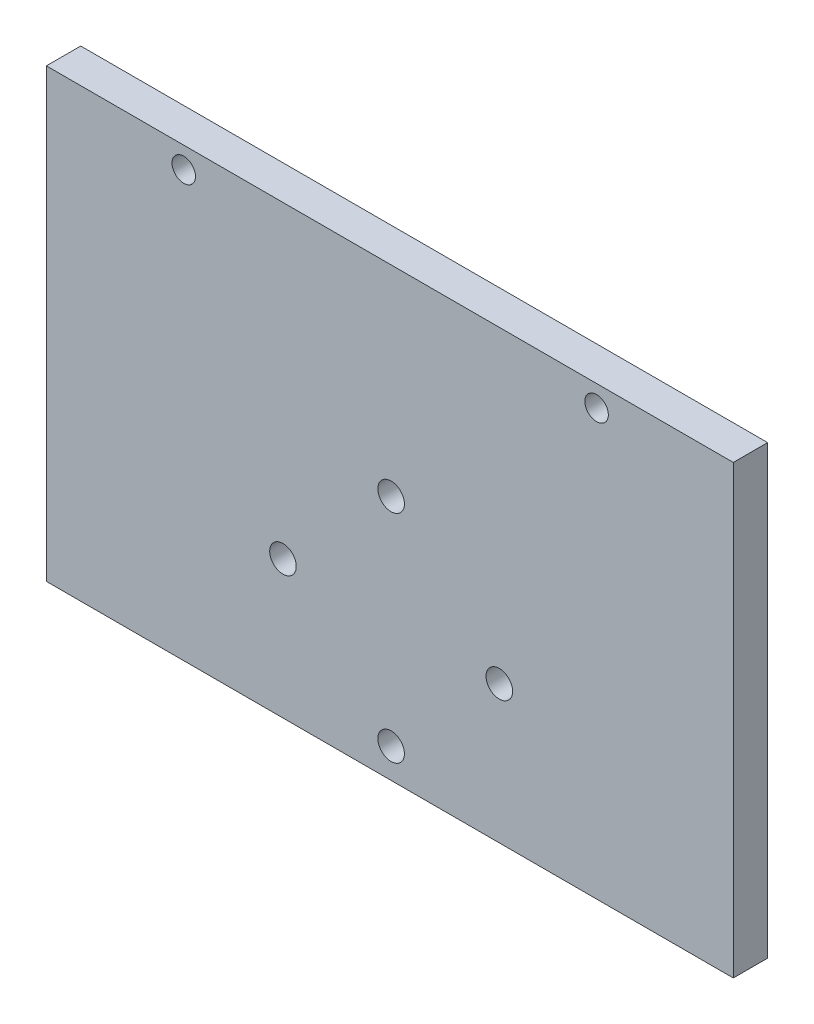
ISO-10303-21;
HEADER;
FILE_DESCRIPTION(('STEP AP214'),'2;1');
FILE_NAME('part.step','',(''),(''),'','','');
FILE_SCHEMA(('AUTOMOTIVE_DESIGN { 1 0 10303 214 1 1 1 1 }'));
ENDSEC;
DATA;
#1=APPLICATION_CONTEXT('core data for automotive mechanical design processes');
#2=APPLICATION_PROTOCOL_DEFINITION('international standard','automotive_design',2000,#1);
#3=PRODUCT_CONTEXT('',#1,'mechanical');
#4=PRODUCT('Part','Part','',(#3));
#5=PRODUCT_RELATED_PRODUCT_CATEGORY('part','',(#4));
#6=PRODUCT_DEFINITION_FORMATION('','',#4);
#7=PRODUCT_DEFINITION_CONTEXT('part definition',#1,'design');
#8=PRODUCT_DEFINITION('design','',#6,#7);
#9=PRODUCT_DEFINITION_SHAPE('','',#8);
#10=(LENGTH_UNIT() NAMED_UNIT(*) SI_UNIT(.MILLI.,.METRE.));
#11=(NAMED_UNIT(*) PLANE_ANGLE_UNIT() SI_UNIT($,.RADIAN.));
#12=(NAMED_UNIT(*) SI_UNIT($,.STERADIAN.) SOLID_ANGLE_UNIT());
#13=UNCERTAINTY_MEASURE_WITH_UNIT(LENGTH_MEASURE(1.E-05),#10,'distance_accuracy_value','');
#14=(GEOMETRIC_REPRESENTATION_CONTEXT(3) GLOBAL_UNCERTAINTY_ASSIGNED_CONTEXT((#13)) GLOBAL_UNIT_ASSIGNED_CONTEXT((#10,
#11,#12)) REPRESENTATION_CONTEXT('',''));
#15=CARTESIAN_POINT('',(0.,0.,0.));
#16=DIRECTION('',(0.,0.,1.));
#17=DIRECTION('',(1.,0.,0.));
#18=AXIS2_PLACEMENT_3D('',#15,#16,#17);
#19=CARTESIAN_POINT('',(63.5,-41.275,6.35));
#20=DIRECTION('',(-1.,0.,0.));
#21=DIRECTION('',(0.,0.,1.));
#22=AXIS2_PLACEMENT_3D('',#19,#20,#21);
#23=PLANE('',#22);
#24=DIRECTION('',(0.,1.,0.));
#25=VECTOR('',#24,1.);
#26=CARTESIAN_POINT('',(63.5,-41.275,0.));
#27=LINE('',#26,#25);
#28=CARTESIAN_POINT('',(63.5,-41.275,0.));
#29=VERTEX_POINT('',#28);
#30=CARTESIAN_POINT('',(63.5,41.275,0.));
#31=VERTEX_POINT('',#30);
#32=EDGE_CURVE('E98',#29,#31,#27,.T.);
#33=ORIENTED_EDGE('',*,*,#32,.T.);
#34=DIRECTION('',(0.,0.,-1.));
#35=VECTOR('',#34,1.);
#36=CARTESIAN_POINT('',(63.5,41.275,6.35));
#37=LINE('',#36,#35);
#38=CARTESIAN_POINT('',(63.5,41.275,6.35));
#39=VERTEX_POINT('',#38);
#40=EDGE_CURVE('E11',#39,#31,#37,.T.);
#41=ORIENTED_EDGE('',*,*,#40,.F.);
#42=DIRECTION('',(0.,1.,0.));
#43=VECTOR('',#42,1.);
#44=CARTESIAN_POINT('',(63.5,-41.275,6.35));
#45=LINE('',#44,#43);
#46=CARTESIAN_POINT('',(63.5,-41.275,6.35));
#47=VERTEX_POINT('',#46);
#48=EDGE_CURVE('E86',#47,#39,#45,.T.);
#49=ORIENTED_EDGE('',*,*,#48,.F.);
#50=DIRECTION('',(0.,0.,-1.));
#51=VECTOR('',#50,1.);
#52=CARTESIAN_POINT('',(63.5,-41.275,6.35));
#53=LINE('',#52,#51);
#54=EDGE_CURVE('E94',#47,#29,#53,.T.);
#55=ORIENTED_EDGE('',*,*,#54,.T.);
#56=EDGE_LOOP('',(#33,#41,#49,#55));
#57=FACE_BOUND('',#56,.T.);
#58=ADVANCED_FACE('F35',(#57),#23,.F.);
#59=CARTESIAN_POINT('',(-63.5,41.275,6.35));
#60=DIRECTION('',(0.,-1.,0.));
#61=DIRECTION('',(0.,0.,-1.));
#62=AXIS2_PLACEMENT_3D('',#59,#60,#61);
#63=PLANE('',#62);
#64=DIRECTION('',(-1.,0.,0.));
#65=VECTOR('',#64,1.);
#66=CARTESIAN_POINT('',(-63.5,41.275,0.));
#67=LINE('',#66,#65);
#68=CARTESIAN_POINT('',(-63.5,41.275,0.));
#69=VERTEX_POINT('',#68);
#70=EDGE_CURVE('E90',#31,#69,#67,.T.);
#71=ORIENTED_EDGE('',*,*,#70,.T.);
#72=DIRECTION('',(0.,0.,-1.));
#73=VECTOR('',#72,1.);
#74=CARTESIAN_POINT('',(-63.5,41.275,6.35));
#75=LINE('',#74,#73);
#76=CARTESIAN_POINT('',(-63.5,41.275,6.35));
#77=VERTEX_POINT('',#76);
#78=EDGE_CURVE('E43',#77,#69,#75,.T.);
#79=ORIENTED_EDGE('',*,*,#78,.F.);
#80=DIRECTION('',(-1.,0.,0.));
#81=VECTOR('',#80,1.);
#82=CARTESIAN_POINT('',(-63.5,41.275,6.35));
#83=LINE('',#82,#81);
#84=EDGE_CURVE('E81',#39,#77,#83,.T.);
#85=ORIENTED_EDGE('',*,*,#84,.F.);
#86=ORIENTED_EDGE('',*,*,#40,.T.);
#87=EDGE_LOOP('',(#71,#79,#85,#86));
#88=FACE_BOUND('',#87,.T.);
#89=ADVANCED_FACE('F89',(#88),#63,.F.);
#90=CARTESIAN_POINT('',(-63.5,-41.275,6.35));
#91=DIRECTION('',(1.,0.,0.));
#92=DIRECTION('',(0.,0.,-1.));
#93=AXIS2_PLACEMENT_3D('',#90,#91,#92);
#94=PLANE('',#93);
#95=DIRECTION('',(0.,-1.,0.));
#96=VECTOR('',#95,1.);
#97=CARTESIAN_POINT('',(-63.5,-41.275,0.));
#98=LINE('',#97,#96);
#99=CARTESIAN_POINT('',(-63.5,-41.275,0.));
#100=VERTEX_POINT('',#99);
#101=EDGE_CURVE('E68',#69,#100,#98,.T.);
#102=ORIENTED_EDGE('',*,*,#101,.T.);
#103=DIRECTION('',(0.,0.,-1.));
#104=VECTOR('',#103,1.);
#105=CARTESIAN_POINT('',(-63.5,-41.275,6.35));
#106=LINE('',#105,#104);
#107=CARTESIAN_POINT('',(-63.5,-41.275,6.35));
#108=VERTEX_POINT('',#107);
#109=EDGE_CURVE('E91',#108,#100,#106,.T.);
#110=ORIENTED_EDGE('',*,*,#109,.F.);
#111=DIRECTION('',(0.,-1.,0.));
#112=VECTOR('',#111,1.);
#113=CARTESIAN_POINT('',(-63.5,-41.275,6.35));
#114=LINE('',#113,#112);
#115=EDGE_CURVE('E84',#77,#108,#114,.T.);
#116=ORIENTED_EDGE('',*,*,#115,.F.);
#117=ORIENTED_EDGE('',*,*,#78,.T.);
#118=EDGE_LOOP('',(#102,#110,#116,#117));
#119=FACE_BOUND('',#118,.T.);
#120=ADVANCED_FACE('F92',(#119),#94,.F.);
#121=CARTESIAN_POINT('',(-63.5,-41.275,6.35));
#122=DIRECTION('',(0.,1.,0.));
#123=DIRECTION('',(0.,0.,1.));
#124=AXIS2_PLACEMENT_3D('',#121,#122,#123);
#125=PLANE('',#124);
#126=DIRECTION('',(1.,0.,0.));
#127=VECTOR('',#126,1.);
#128=CARTESIAN_POINT('',(-63.5,-41.275,0.));
#129=LINE('',#128,#127);
#130=EDGE_CURVE('E74',#100,#29,#129,.T.);
#131=ORIENTED_EDGE('',*,*,#130,.T.);
#132=ORIENTED_EDGE('',*,*,#54,.F.);
#133=DIRECTION('',(1.,0.,0.));
#134=VECTOR('',#133,1.);
#135=CARTESIAN_POINT('',(-63.5,-41.275,6.35));
#136=LINE('',#135,#134);
#137=EDGE_CURVE('E51',#108,#47,#136,.T.);
#138=ORIENTED_EDGE('',*,*,#137,.F.);
#139=ORIENTED_EDGE('',*,*,#109,.T.);
#140=EDGE_LOOP('',(#131,#132,#138,#139));
#141=FACE_BOUND('',#140,.T.);
#142=ADVANCED_FACE('F106',(#141),#125,.F.);
#143=CARTESIAN_POINT('',(0.,0.,6.35));
#144=DIRECTION('',(0.,0.,-1.));
#145=DIRECTION('',(-1.,0.,0.));
#146=AXIS2_PLACEMENT_3D('',#143,#144,#145);
#147=PLANE('',#146);
#148=CARTESIAN_POINT('',(38.2260586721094,37.338,6.35));
#149=DIRECTION('',(0.,0.,1.));
#150=DIRECTION('',(1.,0.,0.));
#151=AXIS2_PLACEMENT_3D('',#148,#149,#150);
#152=CIRCLE('',#151,2.1717);
#153=CARTESIAN_POINT('',(40.3977586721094,37.338,6.35));
#154=VERTEX_POINT('',#153);
#155=EDGE_CURVE('E142',#154,#154,#152,.T.);
#156=ORIENTED_EDGE('',*,*,#155,.F.);
#157=EDGE_LOOP('',(#156));
#158=FACE_BOUND('',#157,.T.);
#159=CARTESIAN_POINT('',(-38.1,37.338,6.35));
#160=DIRECTION('',(0.,0.,1.));
#161=DIRECTION('',(1.,0.,0.));
#162=AXIS2_PLACEMENT_3D('',#159,#160,#161);
#163=CIRCLE('',#162,2.1717);
#164=CARTESIAN_POINT('',(-35.9283,37.338,6.35));
#165=VERTEX_POINT('',#164);
#166=EDGE_CURVE('E136',#165,#165,#163,.T.);
#167=ORIENTED_EDGE('',*,*,#166,.F.);
#168=EDGE_LOOP('',(#167));
#169=FACE_BOUND('',#168,.T.);
#170=CARTESIAN_POINT('',(20.2431563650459,-15.7889200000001,6.35));
#171=DIRECTION('',(0.,0.,1.));
#172=DIRECTION('',(1.,0.,0.));
#173=AXIS2_PLACEMENT_3D('',#170,#171,#172);
#174=CIRCLE('',#173,2.45744999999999);
#175=CARTESIAN_POINT('',(22.7006063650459,-15.7889200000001,6.35));
#176=VERTEX_POINT('',#175);
#177=EDGE_CURVE('E132',#176,#176,#174,.T.);
#178=ORIENTED_EDGE('',*,*,#177,.F.);
#179=EDGE_LOOP('',(#178));
#180=FACE_BOUND('',#179,.T.);
#181=CARTESIAN_POINT('',(-19.7568436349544,-15.78892,6.35));
#182=DIRECTION('',(0.,0.,1.));
#183=DIRECTION('',(1.,0.,0.));
#184=AXIS2_PLACEMENT_3D('',#181,#182,#183);
#185=CIRCLE('',#184,2.45744999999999);
#186=CARTESIAN_POINT('',(-17.2993936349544,-15.78892,6.35));
#187=VERTEX_POINT('',#186);
#188=EDGE_CURVE('E126',#187,#187,#185,.T.);
#189=ORIENTED_EDGE('',*,*,#188,.F.);
#190=EDGE_LOOP('',(#189));
#191=FACE_BOUND('',#190,.T.);
#192=CARTESIAN_POINT('',(0.243156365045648,-35.7889200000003,6.35));
#193=DIRECTION('',(0.,0.,1.));
#194=DIRECTION('',(1.,0.,0.));
#195=AXIS2_PLACEMENT_3D('',#192,#193,#194);
#196=CIRCLE('',#195,2.45744999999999);
#197=CARTESIAN_POINT('',(2.70060636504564,-35.7889200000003,6.35));
#198=VERTEX_POINT('',#197);
#199=EDGE_CURVE('E120',#198,#198,#196,.T.);
#200=ORIENTED_EDGE('',*,*,#199,.F.);
#201=EDGE_LOOP('',(#200));
#202=FACE_BOUND('',#201,.T.);
#203=CARTESIAN_POINT('',(0.243156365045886,4.21108000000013,6.35));
#204=DIRECTION('',(0.,0.,1.));
#205=DIRECTION('',(1.,0.,0.));
#206=AXIS2_PLACEMENT_3D('',#203,#204,#205);
#207=CIRCLE('',#206,2.45744999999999);
#208=CARTESIAN_POINT('',(2.70060636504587,4.21108000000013,6.35));
#209=VERTEX_POINT('',#208);
#210=EDGE_CURVE('E114',#209,#209,#207,.T.);
#211=ORIENTED_EDGE('',*,*,#210,.F.);
#212=EDGE_LOOP('',(#211));
#213=FACE_BOUND('',#212,.T.);
#214=ORIENTED_EDGE('',*,*,#48,.T.);
#215=ORIENTED_EDGE('',*,*,#84,.T.);
#216=ORIENTED_EDGE('',*,*,#115,.T.);
#217=ORIENTED_EDGE('',*,*,#137,.T.);
#218=EDGE_LOOP('',(#214,#215,#216,#217));
#219=FACE_BOUND('',#218,.T.);
#220=ADVANCED_FACE('F82',(#158,#169,#180,#191,#202,#213,#219),#147,.F.);
#221=CARTESIAN_POINT('',(0.,0.,0.));
#222=DIRECTION('',(0.,0.,-1.));
#223=DIRECTION('',(-1.,0.,0.));
#224=AXIS2_PLACEMENT_3D('',#221,#222,#223);
#225=PLANE('',#224);
#226=CARTESIAN_POINT('',(38.2260586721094,37.338,0.));
#227=DIRECTION('',(0.,0.,1.));
#228=DIRECTION('',(1.,0.,0.));
#229=AXIS2_PLACEMENT_3D('',#226,#227,#228);
#230=CIRCLE('',#229,2.1717);
#231=CARTESIAN_POINT('',(40.3977586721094,37.338,0.));
#232=VERTEX_POINT('',#231);
#233=EDGE_CURVE('E139',#232,#232,#230,.T.);
#234=ORIENTED_EDGE('',*,*,#233,.T.);
#235=EDGE_LOOP('',(#234));
#236=FACE_BOUND('',#235,.T.);
#237=CARTESIAN_POINT('',(-38.1,37.338,0.));
#238=DIRECTION('',(0.,0.,1.));
#239=DIRECTION('',(1.,0.,0.));
#240=AXIS2_PLACEMENT_3D('',#237,#238,#239);
#241=CIRCLE('',#240,2.1717);
#242=CARTESIAN_POINT('',(-35.9283,37.338,0.));
#243=VERTEX_POINT('',#242);
#244=EDGE_CURVE('E135',#243,#243,#241,.T.);
#245=ORIENTED_EDGE('',*,*,#244,.T.);
#246=EDGE_LOOP('',(#245));
#247=FACE_BOUND('',#246,.T.);
#248=CARTESIAN_POINT('',(20.2431563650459,-15.7889200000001,0.));
#249=DIRECTION('',(0.,0.,-1.));
#250=DIRECTION('',(-1.,0.,0.));
#251=AXIS2_PLACEMENT_3D('',#248,#249,#250);
#252=CIRCLE('',#251,2.45744999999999);
#253=CARTESIAN_POINT('',(17.785706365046,-15.7889200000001,0.));
#254=VERTEX_POINT('',#253);
#255=EDGE_CURVE('E129',#254,#254,#252,.T.);
#256=ORIENTED_EDGE('',*,*,#255,.F.);
#257=EDGE_LOOP('',(#256));
#258=FACE_BOUND('',#257,.T.);
#259=CARTESIAN_POINT('',(-19.7568436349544,-15.78892,0.));
#260=DIRECTION('',(0.,0.,-1.));
#261=DIRECTION('',(-1.,0.,0.));
#262=AXIS2_PLACEMENT_3D('',#259,#260,#261);
#263=CIRCLE('',#262,2.45744999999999);
#264=CARTESIAN_POINT('',(-22.2142936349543,-15.78892,0.));
#265=VERTEX_POINT('',#264);
#266=EDGE_CURVE('E123',#265,#265,#263,.T.);
#267=ORIENTED_EDGE('',*,*,#266,.F.);
#268=EDGE_LOOP('',(#267));
#269=FACE_BOUND('',#268,.T.);
#270=CARTESIAN_POINT('',(0.243156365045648,-35.7889200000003,0.));
#271=DIRECTION('',(0.,0.,-1.));
#272=DIRECTION('',(-1.,0.,0.));
#273=AXIS2_PLACEMENT_3D('',#270,#271,#272);
#274=CIRCLE('',#273,2.45744999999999);
#275=CARTESIAN_POINT('',(-2.21429363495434,-35.7889200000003,0.));
#276=VERTEX_POINT('',#275);
#277=EDGE_CURVE('E117',#276,#276,#274,.T.);
#278=ORIENTED_EDGE('',*,*,#277,.F.);
#279=EDGE_LOOP('',(#278));
#280=FACE_BOUND('',#279,.T.);
#281=CARTESIAN_POINT('',(0.243156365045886,4.21108000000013,0.));
#282=DIRECTION('',(0.,0.,-1.));
#283=DIRECTION('',(-1.,0.,0.));
#284=AXIS2_PLACEMENT_3D('',#281,#282,#283);
#285=CIRCLE('',#284,2.45744999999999);
#286=CARTESIAN_POINT('',(-2.2142936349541,4.21108000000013,0.));
#287=VERTEX_POINT('',#286);
#288=EDGE_CURVE('E101',#287,#287,#285,.T.);
#289=ORIENTED_EDGE('',*,*,#288,.F.);
#290=EDGE_LOOP('',(#289));
#291=FACE_BOUND('',#290,.T.);
#292=ORIENTED_EDGE('',*,*,#32,.F.);
#293=ORIENTED_EDGE('',*,*,#130,.F.);
#294=ORIENTED_EDGE('',*,*,#101,.F.);
#295=ORIENTED_EDGE('',*,*,#70,.F.);
#296=EDGE_LOOP('',(#292,#293,#294,#295));
#297=FACE_BOUND('',#296,.T.);
#298=ADVANCED_FACE('F109',(#236,#247,#258,#269,#280,#291,#297),#225,.T.);
#299=CARTESIAN_POINT('',(0.243156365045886,4.21108000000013,6.35));
#300=DIRECTION('',(0.,0.,1.));
#301=DIRECTION('',(1.,0.,0.));
#302=AXIS2_PLACEMENT_3D('',#299,#300,#301);
#303=CYLINDRICAL_SURFACE('',#302,2.45744999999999);
#304=ORIENTED_EDGE('',*,*,#288,.T.);
#305=EDGE_LOOP('',(#304));
#306=FACE_BOUND('',#305,.T.);
#307=ORIENTED_EDGE('',*,*,#210,.T.);
#308=EDGE_LOOP('',(#307));
#309=FACE_BOUND('',#308,.T.);
#310=ADVANCED_FACE('F170',(#306,#309),#303,.F.);
#311=CARTESIAN_POINT('',(0.243156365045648,-35.7889200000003,6.35));
#312=DIRECTION('',(0.,0.,1.));
#313=DIRECTION('',(1.,0.,0.));
#314=AXIS2_PLACEMENT_3D('',#311,#312,#313);
#315=CYLINDRICAL_SURFACE('',#314,2.45744999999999);
#316=ORIENTED_EDGE('',*,*,#277,.T.);
#317=EDGE_LOOP('',(#316));
#318=FACE_BOUND('',#317,.T.);
#319=ORIENTED_EDGE('',*,*,#199,.T.);
#320=EDGE_LOOP('',(#319));
#321=FACE_BOUND('',#320,.T.);
#322=ADVANCED_FACE('F172',(#318,#321),#315,.F.);
#323=CARTESIAN_POINT('',(-19.7568436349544,-15.78892,6.35));
#324=DIRECTION('',(0.,0.,1.));
#325=DIRECTION('',(1.,0.,0.));
#326=AXIS2_PLACEMENT_3D('',#323,#324,#325);
#327=CYLINDRICAL_SURFACE('',#326,2.45744999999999);
#328=ORIENTED_EDGE('',*,*,#266,.T.);
#329=EDGE_LOOP('',(#328));
#330=FACE_BOUND('',#329,.T.);
#331=ORIENTED_EDGE('',*,*,#188,.T.);
#332=EDGE_LOOP('',(#331));
#333=FACE_BOUND('',#332,.T.);
#334=ADVANCED_FACE('F179',(#330,#333),#327,.F.);
#335=CARTESIAN_POINT('',(20.2431563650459,-15.7889200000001,6.35));
#336=DIRECTION('',(0.,0.,1.));
#337=DIRECTION('',(1.,0.,0.));
#338=AXIS2_PLACEMENT_3D('',#335,#336,#337);
#339=CYLINDRICAL_SURFACE('',#338,2.45744999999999);
#340=ORIENTED_EDGE('',*,*,#255,.T.);
#341=EDGE_LOOP('',(#340));
#342=FACE_BOUND('',#341,.T.);
#343=ORIENTED_EDGE('',*,*,#177,.T.);
#344=EDGE_LOOP('',(#343));
#345=FACE_BOUND('',#344,.T.);
#346=ADVANCED_FACE('F216',(#342,#345),#339,.F.);
#347=CARTESIAN_POINT('',(-38.1,37.338,0.));
#348=DIRECTION('',(0.,0.,1.));
#349=DIRECTION('',(1.,0.,0.));
#350=AXIS2_PLACEMENT_3D('',#347,#348,#349);
#351=CYLINDRICAL_SURFACE('',#350,2.1717);
#352=ORIENTED_EDGE('',*,*,#244,.F.);
#353=EDGE_LOOP('',(#352));
#354=FACE_BOUND('',#353,.T.);
#355=ORIENTED_EDGE('',*,*,#166,.T.);
#356=EDGE_LOOP('',(#355));
#357=FACE_BOUND('',#356,.T.);
#358=ADVANCED_FACE('F153',(#354,#357),#351,.F.);
#359=CARTESIAN_POINT('',(38.2260586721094,37.338,0.));
#360=DIRECTION('',(0.,0.,1.));
#361=DIRECTION('',(1.,0.,0.));
#362=AXIS2_PLACEMENT_3D('',#359,#360,#361);
#363=CYLINDRICAL_SURFACE('',#362,2.1717);
#364=ORIENTED_EDGE('',*,*,#233,.F.);
#365=EDGE_LOOP('',(#364));
#366=FACE_BOUND('',#365,.T.);
#367=ORIENTED_EDGE('',*,*,#155,.T.);
#368=EDGE_LOOP('',(#367));
#369=FACE_BOUND('',#368,.T.);
#370=ADVANCED_FACE('F150',(#366,#369),#363,.F.);
#371=CLOSED_SHELL('',(#58,#89,#120,#142,#220,#298,#310,#322,#334,#346,#358,#370));
#372=MANIFOLD_SOLID_BREP('B2',#371);
#373=ADVANCED_BREP_SHAPE_REPRESENTATION('',(#18,#372),#14);
#374=SHAPE_DEFINITION_REPRESENTATION(#9,#373);
ENDSEC;
END-ISO-10303-21;
